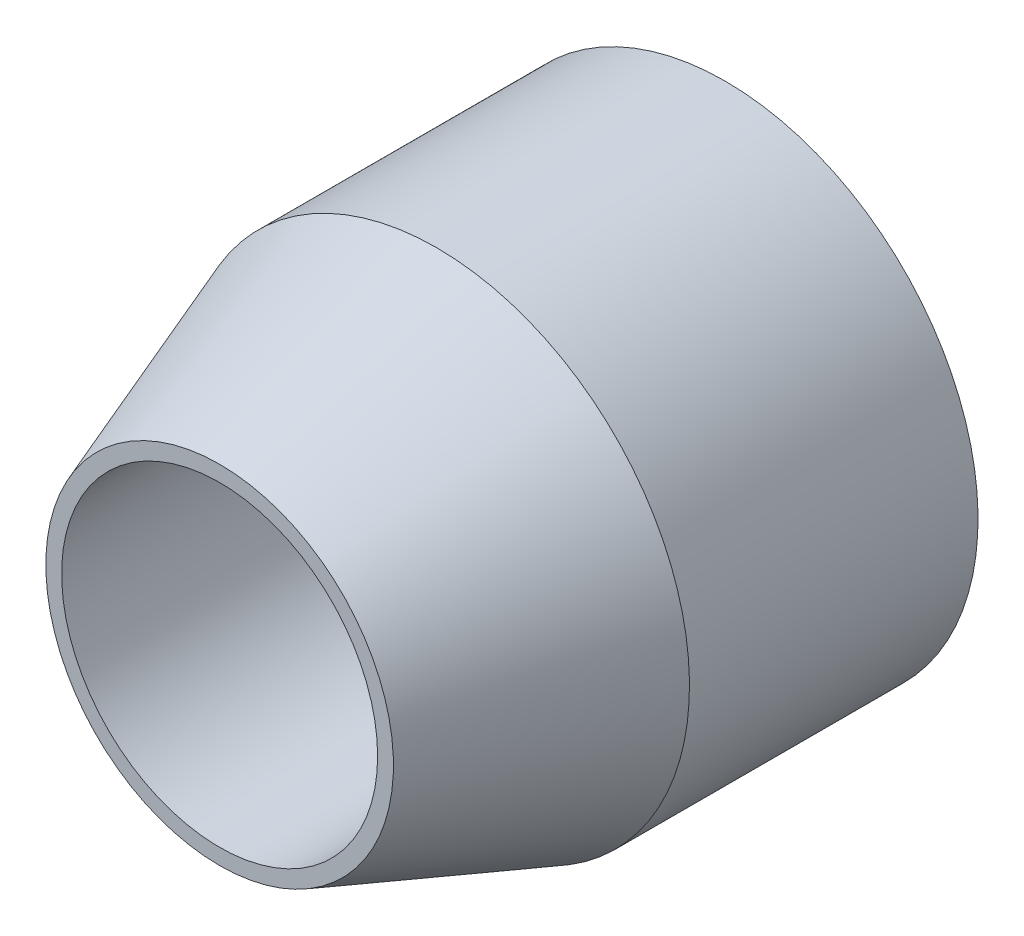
ISO-10303-21;
HEADER;
FILE_DESCRIPTION(('STEP AP214'),'2;1');
FILE_NAME('part.step','',(''),(''),'','','');
FILE_SCHEMA(('AUTOMOTIVE_DESIGN { 1 0 10303 214 1 1 1 1 }'));
ENDSEC;
DATA;
#1=APPLICATION_CONTEXT('core data for automotive mechanical design processes');
#2=APPLICATION_PROTOCOL_DEFINITION('international standard','automotive_design',2000,#1);
#3=PRODUCT_CONTEXT('',#1,'mechanical');
#4=PRODUCT('Part','Part','',(#3));
#5=PRODUCT_RELATED_PRODUCT_CATEGORY('part','',(#4));
#6=PRODUCT_DEFINITION_FORMATION('','',#4);
#7=PRODUCT_DEFINITION_CONTEXT('part definition',#1,'design');
#8=PRODUCT_DEFINITION('design','',#6,#7);
#9=PRODUCT_DEFINITION_SHAPE('','',#8);
#10=(LENGTH_UNIT() NAMED_UNIT(*) SI_UNIT(.MILLI.,.METRE.));
#11=(NAMED_UNIT(*) PLANE_ANGLE_UNIT() SI_UNIT($,.RADIAN.));
#12=(NAMED_UNIT(*) SI_UNIT($,.STERADIAN.) SOLID_ANGLE_UNIT());
#13=UNCERTAINTY_MEASURE_WITH_UNIT(LENGTH_MEASURE(1.E-05),#10,'distance_accuracy_value','');
#14=(GEOMETRIC_REPRESENTATION_CONTEXT(3) GLOBAL_UNCERTAINTY_ASSIGNED_CONTEXT((#13)) GLOBAL_UNIT_ASSIGNED_CONTEXT((#10,
#11,#12)) REPRESENTATION_CONTEXT('',''));
#15=CARTESIAN_POINT('',(0.,0.,0.));
#16=DIRECTION('',(0.,0.,1.));
#17=DIRECTION('',(1.,0.,0.));
#18=AXIS2_PLACEMENT_3D('',#15,#16,#17);
#19=CARTESIAN_POINT('',(0.,0.,-6.35));
#20=DIRECTION('',(0.,0.,-1.));
#21=DIRECTION('',(0.,1.,0.));
#22=AXIS2_PLACEMENT_3D('',#19,#20,#21);
#23=PLANE('',#22);
#24=CARTESIAN_POINT('',(0.,0.,-6.35));
#25=DIRECTION('',(0.,0.,-1.));
#26=DIRECTION('',(0.,1.,0.));
#27=AXIS2_PLACEMENT_3D('',#24,#25,#26);
#28=CIRCLE('',#27,6.35);
#29=CARTESIAN_POINT('',(0.,6.35,-6.35));
#30=VERTEX_POINT('',#29);
#31=EDGE_CURVE('E11',#30,#30,#28,.T.);
#32=ORIENTED_EDGE('',*,*,#31,.T.);
#33=EDGE_LOOP('',(#32));
#34=FACE_BOUND('',#33,.T.);
#35=DIRECTION('',(0.866025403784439,0.5,0.));
#36=VECTOR('',#35,1.);
#37=CARTESIAN_POINT('',(0.,-3.96875,-6.35));
#38=LINE('',#37,#36);
#39=CARTESIAN_POINT('',(0.,-3.96875,-6.35));
#40=VERTEX_POINT('',#39);
#41=CARTESIAN_POINT('',(3.43703832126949,-1.984375,-6.35));
#42=VERTEX_POINT('',#41);
#43=EDGE_CURVE('E193',#40,#42,#38,.T.);
#44=ORIENTED_EDGE('',*,*,#43,.T.);
#45=DIRECTION('',(0.,1.,0.));
#46=VECTOR('',#45,1.);
#47=CARTESIAN_POINT('',(3.43703832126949,-1.984375,-6.35));
#48=LINE('',#47,#46);
#49=CARTESIAN_POINT('',(3.43703832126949,1.984375,-6.35));
#50=VERTEX_POINT('',#49);
#51=EDGE_CURVE('E196',#42,#50,#48,.T.);
#52=ORIENTED_EDGE('',*,*,#51,.T.);
#53=DIRECTION('',(-0.866025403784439,0.5,0.));
#54=VECTOR('',#53,1.);
#55=CARTESIAN_POINT('',(3.43703832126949,1.984375,-6.35));
#56=LINE('',#55,#54);
#57=CARTESIAN_POINT('',(0.,3.96875,-6.35));
#58=VERTEX_POINT('',#57);
#59=EDGE_CURVE('E89',#50,#58,#56,.T.);
#60=ORIENTED_EDGE('',*,*,#59,.T.);
#61=DIRECTION('',(-0.866025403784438,-0.5,0.));
#62=VECTOR('',#61,1.);
#63=CARTESIAN_POINT('',(0.,3.96875,-6.35));
#64=LINE('',#63,#62);
#65=CARTESIAN_POINT('',(-3.43703832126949,1.984375,-6.35));
#66=VERTEX_POINT('',#65);
#67=EDGE_CURVE('E45',#58,#66,#64,.T.);
#68=ORIENTED_EDGE('',*,*,#67,.T.);
#69=DIRECTION('',(0.,-1.,0.));
#70=VECTOR('',#69,1.);
#71=CARTESIAN_POINT('',(-3.43703832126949,1.984375,-6.35));
#72=LINE('',#71,#70);
#73=CARTESIAN_POINT('',(-3.43703832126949,-1.984375,-6.35));
#74=VERTEX_POINT('',#73);
#75=EDGE_CURVE('E187',#66,#74,#72,.T.);
#76=ORIENTED_EDGE('',*,*,#75,.T.);
#77=DIRECTION('',(0.866025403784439,-0.5,0.));
#78=VECTOR('',#77,1.);
#79=CARTESIAN_POINT('',(-3.43703832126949,-1.984375,-6.35));
#80=LINE('',#79,#78);
#81=EDGE_CURVE('E190',#74,#40,#80,.T.);
#82=ORIENTED_EDGE('',*,*,#81,.T.);
#83=EDGE_LOOP('',(#44,#52,#60,#68,#76,#82));
#84=FACE_BOUND('',#83,.T.);
#85=ADVANCED_FACE('F31',(#34,#84),#23,.T.);
#86=CARTESIAN_POINT('',(0.,0.,0.));
#87=DIRECTION('',(0.,0.,1.));
#88=DIRECTION('',(1.,0.,0.));
#89=AXIS2_PLACEMENT_3D('',#86,#87,#88);
#90=CONICAL_SURFACE('',#89,3.96875,1.02974425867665);
#91=CARTESIAN_POINT('',(3.43703832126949,-5.00010604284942,1.26104318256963));
#92=CARTESIAN_POINT('',(3.43703832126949,-4.85722093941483,1.19031289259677));
#93=CARTESIAN_POINT('',(3.43703832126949,-4.71395906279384,1.12032961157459));
#94=CARTESIAN_POINT('',(3.43703832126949,-4.42648772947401,0.982269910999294));
#95=CARTESIAN_POINT('',(3.43703832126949,-4.28227810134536,0.914193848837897));
#96=CARTESIAN_POINT('',(3.43703832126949,-3.99188496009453,0.779978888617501));
#97=CARTESIAN_POINT('',(3.43703832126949,-3.84569476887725,0.713854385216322));
#98=CARTESIAN_POINT('',(3.43703832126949,-3.55200830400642,0.584582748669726));
#99=CARTESIAN_POINT('',(3.43703832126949,-3.40451209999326,0.521435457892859));
#100=CARTESIAN_POINT('',(3.43703832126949,-3.10400936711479,0.397253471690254));
#101=CARTESIAN_POINT('',(3.43703832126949,-2.9509607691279,0.336319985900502));
#102=CARTESIAN_POINT('',(3.43703832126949,-2.64291751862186,0.219492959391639));
#103=CARTESIAN_POINT('',(3.43703832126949,-2.48792264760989,0.163599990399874));
#104=CARTESIAN_POINT('',(3.43703832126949,-2.17608605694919,0.0584056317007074));
#105=CARTESIAN_POINT('',(3.43703832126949,-2.01924940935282,0.00908936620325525));
#106=CARTESIAN_POINT('',(3.43703832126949,-1.70324804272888,-0.0813228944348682));
#107=CARTESIAN_POINT('',(3.43703832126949,-1.54408410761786,-0.122421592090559));
#108=CARTESIAN_POINT('',(3.43703832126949,-1.21766592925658,-0.195665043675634));
#109=CARTESIAN_POINT('',(3.43703832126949,-1.0503261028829,-0.227436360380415));
#110=CARTESIAN_POINT('',(3.43703832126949,-0.713631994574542,-0.277711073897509));
#111=CARTESIAN_POINT('',(3.43703832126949,-0.544277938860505,-0.296215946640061));
#112=CARTESIAN_POINT('',(3.43703832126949,-0.206709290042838,-0.318177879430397));
#113=CARTESIAN_POINT('',(3.43703832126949,-0.0385071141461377,-0.321821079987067));
#114=CARTESIAN_POINT('',(3.43703832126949,0.297575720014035,-0.314215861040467));
#115=CARTESIAN_POINT('',(3.43703832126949,0.465456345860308,-0.302966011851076));
#116=CARTESIAN_POINT('',(3.43703832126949,0.750251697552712,-0.272006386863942));
#117=CARTESIAN_POINT('',(3.43703832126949,0.867564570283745,-0.255779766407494));
#118=CARTESIAN_POINT('',(3.43703832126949,1.10117192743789,-0.217131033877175));
#119=CARTESIAN_POINT('',(3.43703832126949,1.21746626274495,-0.194708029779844));
#120=CARTESIAN_POINT('',(3.43703832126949,1.56471784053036,-0.119260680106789));
#121=CARTESIAN_POINT('',(3.43703832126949,1.79391569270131,-0.0580734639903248));
#122=CARTESIAN_POINT('',(3.43703832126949,2.13655651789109,0.0462687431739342));
#123=CARTESIAN_POINT('',(3.43703832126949,2.25186065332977,0.0836346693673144));
#124=CARTESIAN_POINT('',(3.43703832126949,2.48130331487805,0.161818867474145));
#125=CARTESIAN_POINT('',(3.43703832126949,2.59544183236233,0.202637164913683));
#126=CARTESIAN_POINT('',(3.43703832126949,2.82260033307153,0.287127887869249));
#127=CARTESIAN_POINT('',(3.43703832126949,2.93562071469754,0.330799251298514));
#128=CARTESIAN_POINT('',(3.43703832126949,3.16070198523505,0.42053562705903));
#129=CARTESIAN_POINT('',(3.43703832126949,3.27276289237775,0.466600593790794));
#130=CARTESIAN_POINT('',(3.43703832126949,3.56812951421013,0.591117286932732));
#131=CARTESIAN_POINT('',(3.43703832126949,3.75071539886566,0.6712748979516));
#132=CARTESIAN_POINT('',(3.43703832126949,4.11405354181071,0.835656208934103));
#133=CARTESIAN_POINT('',(3.43703832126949,4.29480563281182,0.919880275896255));
#134=CARTESIAN_POINT('',(3.43703832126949,4.65487623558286,1.09146098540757));
#135=CARTESIAN_POINT('',(3.43703832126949,4.83419432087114,1.17881852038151));
#136=CARTESIAN_POINT('',(3.43703832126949,5.19163194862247,1.35595614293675));
#137=CARTESIAN_POINT('',(3.43703832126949,5.36975145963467,1.4457362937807));
#138=CARTESIAN_POINT('',(3.43703832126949,5.90314806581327,1.71816204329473));
#139=CARTESIAN_POINT('',(3.43703832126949,6.25696985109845,1.90365406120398));
#140=CARTESIAN_POINT('',(3.43703832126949,6.9619346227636,2.2794824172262));
#141=CARTESIAN_POINT('',(3.43703832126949,7.31307805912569,2.46981791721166));
#142=CARTESIAN_POINT('',(3.43703832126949,7.97820710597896,2.8344742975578));
#143=CARTESIAN_POINT('',(3.43703832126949,8.29236882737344,3.00847448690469));
#144=CARTESIAN_POINT('',(3.43703832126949,8.91959665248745,3.35847259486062));
#145=CARTESIAN_POINT('',(3.43703832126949,9.23266269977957,3.53447061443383));
#146=CARTESIAN_POINT('',(3.43703832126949,9.85702823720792,3.88744000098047));
#147=CARTESIAN_POINT('',(3.43703832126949,10.1683302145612,4.06440697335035));
#148=CARTESIAN_POINT('',(3.43703832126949,10.7902479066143,4.41949462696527));
#149=CARTESIAN_POINT('',(3.43703832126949,11.1008636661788,4.5976152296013));
#150=CARTESIAN_POINT('',(3.43703832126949,11.4112344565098,4.77615885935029));
#151=B_SPLINE_CURVE_WITH_KNOTS('',3,(#91,#92,#93,#94,#95,#96,#97,#98,#99,#100,#101,#102,#103,
#104,#105,#106,#107,#108,#109,#110,#111,#112,#113,#114,#115,#116,#117,#118,#119,#120,#121,#122,
#123,#124,#125,#126,#127,#128,#129,#130,#131,#132,#133,#134,#135,#136,#137,#138,#139,#140,#141,
#142,#143,#144,#145,#146,#147,#148,#149,#150),.UNSPECIFIED.,.F.,.F.,(4,2,2,2,2,2,2,2,2,2,2,2,2,
2,2,2,2,2,2,2,2,2,2,2,2,2,2,2,2,4),(0.,0.478306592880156,0.95670222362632,1.43802381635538,
1.9193198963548,2.41344781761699,2.9076317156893,3.40067814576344,3.8935621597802,
4.40410021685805,4.9145814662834,5.41864899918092,5.92276492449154,6.27788431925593,
6.63305486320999,7.34378093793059,7.7073758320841,8.07097341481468,8.43443640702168,
8.79789247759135,9.39603815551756,9.99423791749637,10.5926094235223,11.1909965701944,
12.3894149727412,13.5876273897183,14.6650045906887,15.7424364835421,16.8166944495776,
17.890879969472),.UNSPECIFIED.);
#152=CARTESIAN_POINT('',(3.43703832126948,1.984375,0.));
#153=VERTEX_POINT('',#152);
#154=CARTESIAN_POINT('',(3.43703832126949,-1.984375,0.));
#155=VERTEX_POINT('',#154);
#156=EDGE_CURVE('E95',#153,#155,#151,.F.);
#157=ORIENTED_EDGE('',*,*,#156,.T.);
#158=CARTESIAN_POINT('',(0.,0.,0.));
#159=DIRECTION('',(0.,0.,1.));
#160=DIRECTION('',(1.,0.,0.));
#161=AXIS2_PLACEMENT_3D('',#158,#159,#160);
#162=CIRCLE('',#161,3.96875);
#163=EDGE_CURVE('E118',#155,#153,#162,.T.);
#164=ORIENTED_EDGE('',*,*,#163,.T.);
#165=EDGE_LOOP('',(#157,#164));
#166=FACE_BOUND('',#165,.T.);
#167=ADVANCED_FACE('F179',(#166),#90,.F.);
#168=CARTESIAN_POINT('',(3.43723832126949,-1.98425952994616,6.93844359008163E-05));
#169=CARTESIAN_POINT('',(3.28565097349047,-2.07177852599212,-0.052535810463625));
#170=CARTESIAN_POINT('',(3.13264633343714,-2.16011579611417,-0.100400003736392));
#171=CARTESIAN_POINT('',(2.82375775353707,-2.33845270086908,-0.183923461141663));
#172=CARTESIAN_POINT('',(2.6678672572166,-2.42845612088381,-0.219550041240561));
#173=CARTESIAN_POINT('',(2.35818041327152,-2.60725390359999,-0.274814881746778));
#174=CARTESIAN_POINT('',(2.20444009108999,-2.69601591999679,-0.294856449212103));
#175=CARTESIAN_POINT('',(1.89619313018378,-2.87398238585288,-0.318530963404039));
#176=CARTESIAN_POINT('',(1.7416878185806,-2.9631860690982,-0.322186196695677));
#177=CARTESIAN_POINT('',(1.45436820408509,-3.12907012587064,-0.313425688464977));
#178=CARTESIAN_POINT('',(1.32150030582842,-3.20578144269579,-0.303156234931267));
#179=CARTESIAN_POINT('',(1.05670596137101,-3.35866052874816,-0.270990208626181));
#180=CARTESIAN_POINT('',(0.92478060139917,-3.43482767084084,-0.249081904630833));
#181=CARTESIAN_POINT('',(0.659411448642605,-3.58803862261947,-0.194457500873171));
#182=CARTESIAN_POINT('',(0.526006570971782,-3.66505996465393,-0.161495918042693));
#183=CARTESIAN_POINT('',(0.261335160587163,-3.81786807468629,-0.0868184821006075));
#184=CARTESIAN_POINT('',(0.130064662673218,-3.89365713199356,-0.0451215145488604));
#185=CARTESIAN_POINT('',(-0.000199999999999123,-3.96886547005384,6.9384435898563E-05));
#186=B_SPLINE_CURVE_WITH_KNOTS('',3,(#168,#169,#170,#171,#172,#173,#174,#175,#176,#177,#178,
#179,#180,#181,#182,#183,#184,#185),.UNSPECIFIED.,.F.,.F.,(4,2,2,2,2,2,2,2,4),(0.,
0.54855831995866,1.09857053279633,1.63382645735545,2.16835417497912,2.629184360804,
3.09047991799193,3.56278583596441,4.03408099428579),.UNSPECIFIED.);
#187=CARTESIAN_POINT('',(0.,-3.96875,0.));
#188=VERTEX_POINT('',#187);
#189=EDGE_CURVE('E149',#155,#188,#186,.T.);
#190=ORIENTED_EDGE('',*,*,#189,.T.);
#191=EDGE_CURVE('E123',#188,#155,#162,.T.);
#192=ORIENTED_EDGE('',*,*,#191,.T.);
#193=EDGE_LOOP('',(#190,#192));
#194=FACE_BOUND('',#193,.T.);
#195=ADVANCED_FACE('F215',(#194),#90,.F.);
#196=CARTESIAN_POINT('',(0.000200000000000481,-3.96886547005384,6.93844358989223E-05));
#197=CARTESIAN_POINT('',(-0.151387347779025,-3.88134647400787,-0.0525358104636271));
#198=CARTESIAN_POINT('',(-0.30439198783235,-3.79300920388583,-0.100400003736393));
#199=CARTESIAN_POINT('',(-0.613280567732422,-3.61467229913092,-0.183923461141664));
#200=CARTESIAN_POINT('',(-0.769171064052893,-3.52466887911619,-0.219550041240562));
#201=CARTESIAN_POINT('',(-1.07885790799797,-3.34587109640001,-0.274814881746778));
#202=CARTESIAN_POINT('',(-1.2325982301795,-3.25710908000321,-0.294856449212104));
#203=CARTESIAN_POINT('',(-1.54084519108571,-3.07914261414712,-0.318530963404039));
#204=CARTESIAN_POINT('',(-1.69535050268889,-2.9899389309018,-0.322186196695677));
#205=CARTESIAN_POINT('',(-1.9826701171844,-2.82405487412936,-0.313425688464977));
#206=CARTESIAN_POINT('',(-2.11553801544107,-2.74734355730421,-0.303156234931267));
#207=CARTESIAN_POINT('',(-2.38033235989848,-2.59446447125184,-0.270990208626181));
#208=CARTESIAN_POINT('',(-2.51225771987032,-2.51829732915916,-0.249081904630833));
#209=CARTESIAN_POINT('',(-2.77762687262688,-2.36508637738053,-0.19445750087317));
#210=CARTESIAN_POINT('',(-2.91103175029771,-2.28806503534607,-0.161495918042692));
#211=CARTESIAN_POINT('',(-3.17570316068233,-2.13525692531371,-0.0868184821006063));
#212=CARTESIAN_POINT('',(-3.30697365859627,-2.05946786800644,-0.0451215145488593));
#213=CARTESIAN_POINT('',(-3.43723832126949,-1.98425952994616,6.93844358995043E-05));
#214=B_SPLINE_CURVE_WITH_KNOTS('',3,(#196,#197,#198,#199,#200,#201,#202,#203,#204,#205,#206,
#207,#208,#209,#210,#211,#212,#213),.UNSPECIFIED.,.F.,.F.,(4,2,2,2,2,2,2,2,4),(0.,
0.54855831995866,1.09857053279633,1.63382645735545,2.16835417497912,2.629184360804,
3.09047991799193,3.56278583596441,4.03408099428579),.UNSPECIFIED.);
#215=CARTESIAN_POINT('',(-3.43703832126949,-1.984375,0.));
#216=VERTEX_POINT('',#215);
#217=EDGE_CURVE('E155',#188,#216,#214,.T.);
#218=ORIENTED_EDGE('',*,*,#217,.T.);
#219=EDGE_CURVE('E127',#216,#188,#162,.T.);
#220=ORIENTED_EDGE('',*,*,#219,.T.);
#221=EDGE_LOOP('',(#218,#220));
#222=FACE_BOUND('',#221,.T.);
#223=ADVANCED_FACE('F218',(#222),#90,.F.);
#224=CARTESIAN_POINT('',(-3.43703832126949,-5.00010604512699,1.26104318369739));
#225=CARTESIAN_POINT('',(-3.43703832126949,-4.85722094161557,1.19031289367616));
#226=CARTESIAN_POINT('',(-3.43703832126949,-4.71395906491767,1.12032961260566));
#227=CARTESIAN_POINT('',(-3.43703832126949,-4.4264877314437,0.982269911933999));
#228=CARTESIAN_POINT('',(-3.43703832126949,-4.28227810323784,0.914193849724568));
#229=CARTESIAN_POINT('',(-3.43703832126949,-3.99188496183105,0.77997888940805));
#230=CARTESIAN_POINT('',(-3.43703832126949,-3.84569477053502,0.713854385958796));
#231=CARTESIAN_POINT('',(-3.43703832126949,-3.55200830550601,0.584582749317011));
#232=CARTESIAN_POINT('',(-3.43703832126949,-3.40451210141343,0.521435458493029));
#233=CARTESIAN_POINT('',(-3.43703832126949,-3.10400936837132,0.397253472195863));
#234=CARTESIAN_POINT('',(-3.43703832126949,-2.95096077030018,0.336319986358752));
#235=CARTESIAN_POINT('',(-3.43703832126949,-2.64291751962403,0.219492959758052));
#236=CARTESIAN_POINT('',(-3.43703832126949,-2.48792264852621,0.163599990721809));
#237=CARTESIAN_POINT('',(-3.43703832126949,-2.17608605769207,0.0584056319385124));
#238=CARTESIAN_POINT('',(-3.43703832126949,-2.01924941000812,0.00908936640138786));
#239=CARTESIAN_POINT('',(-3.43703832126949,-1.70324804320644,-0.0813228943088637));
#240=CARTESIAN_POINT('',(-3.43703832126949,-1.54408410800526,-0.122421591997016));
#241=CARTESIAN_POINT('',(-3.43703832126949,-1.21766592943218,-0.195665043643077));
#242=CARTESIAN_POINT('',(-3.43703832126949,-1.05032610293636,-0.227436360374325));
#243=CARTESIAN_POINT('',(-3.43703832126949,-0.713631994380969,-0.277711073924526));
#244=CARTESIAN_POINT('',(-3.43703832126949,-0.544277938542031,-0.296215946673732));
#245=CARTESIAN_POINT('',(-3.43703832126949,-0.206709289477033,-0.318177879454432));
#246=CARTESIAN_POINT('',(-3.43703832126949,-0.0385071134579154,-0.32182107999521));
#247=CARTESIAN_POINT('',(-3.43703832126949,0.297575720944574,-0.314215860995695));
#248=CARTESIAN_POINT('',(-3.43703832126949,0.465456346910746,-0.302966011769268));
#249=CARTESIAN_POINT('',(-3.43703832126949,0.750251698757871,-0.272006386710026));
#250=CARTESIAN_POINT('',(-3.43703832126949,0.867564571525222,-0.255779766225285));
#251=CARTESIAN_POINT('',(-3.43703832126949,1.10117192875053,-0.217131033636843));
#252=CARTESIAN_POINT('',(-3.43703832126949,1.21746626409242,-0.194708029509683));
#253=CARTESIAN_POINT('',(-3.43703832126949,1.56471784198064,-0.119260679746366));
#254=CARTESIAN_POINT('',(-3.43703832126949,1.79391569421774,-0.0580734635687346));
#255=CARTESIAN_POINT('',(-3.43703832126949,2.13655651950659,0.0462687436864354));
#256=CARTESIAN_POINT('',(-3.43703832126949,2.25186065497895,0.0836346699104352));
#257=CARTESIAN_POINT('',(-3.43703832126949,2.48130331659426,0.161818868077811));
#258=CARTESIAN_POINT('',(-3.43703832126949,2.59544183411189,0.202637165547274));
#259=CARTESIAN_POINT('',(-3.43703832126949,2.82260033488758,0.28712788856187));
#260=CARTESIAN_POINT('',(-3.43703832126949,2.93562071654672,0.33079925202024));
#261=CARTESIAN_POINT('',(-3.43703832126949,3.16070198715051,0.420535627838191));
#262=CARTESIAN_POINT('',(-3.43703832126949,3.27276289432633,0.466600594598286));
#263=CARTESIAN_POINT('',(-3.43703832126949,3.56812951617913,0.591117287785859));
#264=CARTESIAN_POINT('',(-3.43703832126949,3.75071540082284,0.671274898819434));
#265=CARTESIAN_POINT('',(-3.43703832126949,4.11405354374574,0.835656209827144));
#266=CARTESIAN_POINT('',(-3.43703832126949,4.29480563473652,0.919880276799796));
#267=CARTESIAN_POINT('',(-3.43703832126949,4.65487623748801,1.09146098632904));
#268=CARTESIAN_POINT('',(-3.43703832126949,4.83419432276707,1.17881852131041));
#269=CARTESIAN_POINT('',(-3.43703832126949,5.1916319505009,1.35595614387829));
#270=CARTESIAN_POINT('',(-3.43703832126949,5.36975146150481,1.44573629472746));
#271=CARTESIAN_POINT('',(-3.43703832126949,5.90314806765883,1.71816204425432));
#272=CARTESIAN_POINT('',(-3.43703832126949,6.2569698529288,1.90365406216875));
#273=CARTESIAN_POINT('',(-3.43703832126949,6.9619346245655,2.27948241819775));
#274=CARTESIAN_POINT('',(-3.43703832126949,7.31307806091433,2.46981791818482));
#275=CARTESIAN_POINT('',(-3.43703832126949,7.97820710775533,2.83447429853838));
#276=CARTESIAN_POINT('',(-3.43703832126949,8.29236882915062,3.00847448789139));
#277=CARTESIAN_POINT('',(-3.43703832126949,8.91959665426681,3.35847259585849));
#278=CARTESIAN_POINT('',(-3.43703832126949,9.23266270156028,3.53447061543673));
#279=CARTESIAN_POINT('',(-3.43703832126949,9.85702823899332,3.88744000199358));
#280=CARTESIAN_POINT('',(-3.43703832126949,10.1683302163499,4.06440697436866));
#281=CARTESIAN_POINT('',(-3.43703832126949,10.79024790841,4.41949462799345));
#282=CARTESIAN_POINT('',(-3.43703832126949,11.1008636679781,4.59761523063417));
#283=CARTESIAN_POINT('',(-3.43703832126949,11.4112344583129,4.77615886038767));
#284=B_SPLINE_CURVE_WITH_KNOTS('',3,(#224,#225,#226,#227,#228,#229,#230,#231,#232,#233,#234,
#235,#236,#237,#238,#239,#240,#241,#242,#243,#244,#245,#246,#247,#248,#249,#250,#251,#252,#253,
#254,#255,#256,#257,#258,#259,#260,#261,#262,#263,#264,#265,#266,#267,#268,#269,#270,#271,#272,
#273,#274,#275,#276,#277,#278,#279,#280,#281,#282,#283),.UNSPECIFIED.,.F.,.F.,(4,2,2,2,2,2,2,2,
2,2,2,2,2,2,2,2,2,2,2,2,2,2,2,2,2,2,2,2,2,4),(0.,0.478306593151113,0.956702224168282,
1.43802381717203,1.91931989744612,2.41344781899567,2.90763171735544,3.40067814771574,
3.89356216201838,4.40410021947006,4.91458146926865,5.41864900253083,5.92276492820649,
6.27788432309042,6.63305486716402,7.34378094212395,7.70737583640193,8.07097341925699,
8.43443641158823,8.79789248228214,9.39603816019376,9.99423792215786,10.5926094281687,
11.1909965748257,12.3894149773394,13.5876273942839,14.6650045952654,15.7424364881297,
16.8166944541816,17.8908799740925),.UNSPECIFIED.);
#285=CARTESIAN_POINT('',(-3.43703832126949,1.98437499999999,0.));
#286=VERTEX_POINT('',#285);
#287=EDGE_CURVE('E103',#216,#286,#284,.T.);
#288=ORIENTED_EDGE('',*,*,#287,.T.);
#289=EDGE_CURVE('E114',#286,#216,#162,.T.);
#290=ORIENTED_EDGE('',*,*,#289,.T.);
#291=EDGE_LOOP('',(#288,#290));
#292=FACE_BOUND('',#291,.T.);
#293=ADVANCED_FACE('F220',(#292),#90,.F.);
#294=CARTESIAN_POINT('',(-3.43723832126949,1.98425952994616,6.93844359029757E-05));
#295=CARTESIAN_POINT('',(-3.28565097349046,2.07177852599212,-0.0525358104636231));
#296=CARTESIAN_POINT('',(-3.13264633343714,2.16011579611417,-0.10040000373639));
#297=CARTESIAN_POINT('',(-2.82375775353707,2.33845270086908,-0.18392346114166));
#298=CARTESIAN_POINT('',(-2.6678672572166,2.42845612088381,-0.219550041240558));
#299=CARTESIAN_POINT('',(-2.35818041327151,2.60725390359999,-0.274814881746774));
#300=CARTESIAN_POINT('',(-2.20444009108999,2.69601591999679,-0.2948564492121));
#301=CARTESIAN_POINT('',(-1.89619313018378,2.87398238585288,-0.318530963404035));
#302=CARTESIAN_POINT('',(-1.7416878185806,2.9631860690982,-0.322186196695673));
#303=CARTESIAN_POINT('',(-1.45436820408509,3.12907012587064,-0.313425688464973));
#304=CARTESIAN_POINT('',(-1.32150030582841,3.20578144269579,-0.303156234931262));
#305=CARTESIAN_POINT('',(-1.05670596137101,3.35866052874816,-0.270990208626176));
#306=CARTESIAN_POINT('',(-0.924780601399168,3.43482767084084,-0.249081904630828));
#307=CARTESIAN_POINT('',(-0.659411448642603,3.58803862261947,-0.194457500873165));
#308=CARTESIAN_POINT('',(-0.52600657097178,3.66505996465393,-0.161495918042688));
#309=CARTESIAN_POINT('',(-0.261335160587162,3.81786807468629,-0.0868184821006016));
#310=CARTESIAN_POINT('',(-0.130064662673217,3.89365713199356,-0.0451215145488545));
#311=CARTESIAN_POINT('',(0.00020000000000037,3.96886547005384,6.93844359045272E-05));
#312=B_SPLINE_CURVE_WITH_KNOTS('',3,(#294,#295,#296,#297,#298,#299,#300,#301,#302,#303,#304,
#305,#306,#307,#308,#309,#310,#311),.UNSPECIFIED.,.F.,.F.,(4,2,2,2,2,2,2,2,4),(0.,
0.548558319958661,1.09857053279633,1.63382645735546,2.16835417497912,2.629184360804,
3.09047991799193,3.56278583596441,4.03408099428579),.UNSPECIFIED.);
#313=CARTESIAN_POINT('',(0.,3.96874999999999,0.));
#314=VERTEX_POINT('',#313);
#315=EDGE_CURVE('E90',#286,#314,#312,.T.);
#316=ORIENTED_EDGE('',*,*,#315,.T.);
#317=EDGE_CURVE('E102',#314,#286,#162,.T.);
#318=ORIENTED_EDGE('',*,*,#317,.T.);
#319=EDGE_LOOP('',(#316,#318));
#320=FACE_BOUND('',#319,.T.);
#321=ADVANCED_FACE('F101',(#320),#90,.F.);
#322=CARTESIAN_POINT('',(-0.000200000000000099,3.96886547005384,6.93844359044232E-05));
#323=CARTESIAN_POINT('',(0.151387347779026,3.88134647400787,-0.0525358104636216));
#324=CARTESIAN_POINT('',(0.304391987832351,3.79300920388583,-0.100400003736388));
#325=CARTESIAN_POINT('',(0.613280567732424,3.61467229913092,-0.183923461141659));
#326=CARTESIAN_POINT('',(0.769171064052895,3.52466887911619,-0.219550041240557));
#327=CARTESIAN_POINT('',(1.07885790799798,3.34587109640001,-0.274814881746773));
#328=CARTESIAN_POINT('',(1.2325982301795,3.25710908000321,-0.294856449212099));
#329=CARTESIAN_POINT('',(1.54084519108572,3.07914261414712,-0.318530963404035));
#330=CARTESIAN_POINT('',(1.6953505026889,2.9899389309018,-0.322186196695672));
#331=CARTESIAN_POINT('',(1.98267011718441,2.82405487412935,-0.313425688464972));
#332=CARTESIAN_POINT('',(2.11553801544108,2.74734355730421,-0.303156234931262));
#333=CARTESIAN_POINT('',(2.38033235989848,2.59446447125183,-0.270990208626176));
#334=CARTESIAN_POINT('',(2.51225771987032,2.51829732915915,-0.249081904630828));
#335=CARTESIAN_POINT('',(2.77762687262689,2.36508637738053,-0.194457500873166));
#336=CARTESIAN_POINT('',(2.91103175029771,2.28806503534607,-0.161495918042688));
#337=CARTESIAN_POINT('',(3.17570316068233,2.13525692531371,-0.0868184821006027));
#338=CARTESIAN_POINT('',(3.30697365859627,2.05946786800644,-0.0451215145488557));
#339=CARTESIAN_POINT('',(3.43723832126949,1.98425952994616,6.93844359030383E-05));
#340=B_SPLINE_CURVE_WITH_KNOTS('',3,(#322,#323,#324,#325,#326,#327,#328,#329,#330,#331,#332,
#333,#334,#335,#336,#337,#338,#339),.UNSPECIFIED.,.F.,.F.,(4,2,2,2,2,2,2,2,4),(0.,
0.548558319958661,1.09857053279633,1.63382645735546,2.16835417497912,2.62918436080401,
3.09047991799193,3.56278583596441,4.03408099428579),.UNSPECIFIED.);
#341=EDGE_CURVE('E82',#314,#153,#340,.T.);
#342=ORIENTED_EDGE('',*,*,#341,.T.);
#343=EDGE_CURVE('E111',#153,#314,#162,.T.);
#344=ORIENTED_EDGE('',*,*,#343,.T.);
#345=EDGE_LOOP('',(#342,#344));
#346=FACE_BOUND('',#345,.T.);
#347=ADVANCED_FACE('F116',(#346),#90,.F.);
#348=CARTESIAN_POINT('',(0.,0.,-31.1289207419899));
#349=DIRECTION('',(0.,0.,-1.));
#350=DIRECTION('',(0.,1.,0.));
#351=AXIS2_PLACEMENT_3D('',#348,#349,#350);
#352=CYLINDRICAL_SURFACE('',#351,6.35);
#353=CARTESIAN_POINT('',(0.,0.,0.897974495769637));
#354=DIRECTION('',(0.,0.,-1.));
#355=DIRECTION('',(0.,1.,0.));
#356=AXIS2_PLACEMENT_3D('',#353,#354,#355);
#357=CIRCLE('',#356,6.35);
#358=CARTESIAN_POINT('',(0.,6.35,0.897974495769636));
#359=VERTEX_POINT('',#358);
#360=EDGE_CURVE('E38',#359,#359,#357,.T.);
#361=ORIENTED_EDGE('',*,*,#360,.T.);
#362=EDGE_LOOP('',(#361));
#363=FACE_BOUND('',#362,.T.);
#364=ORIENTED_EDGE('',*,*,#31,.F.);
#365=EDGE_LOOP('',(#364));
#366=FACE_BOUND('',#365,.T.);
#367=ADVANCED_FACE('F232',(#363,#366),#352,.T.);
#368=CARTESIAN_POINT('',(0.,0.,0.897974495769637));
#369=DIRECTION('',(0.,0.,-1.));
#370=DIRECTION('',(0.,1.,0.));
#371=AXIS2_PLACEMENT_3D('',#368,#369,#370);
#372=CONICAL_SURFACE('',#371,6.35,0.34906585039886);
#373=CARTESIAN_POINT('',(0.,0.,6.35));
#374=DIRECTION('',(0.,0.,-1.));
#375=DIRECTION('',(0.,1.,0.));
#376=AXIS2_PLACEMENT_3D('',#373,#374,#375);
#377=CIRCLE('',#376,4.365625);
#378=CARTESIAN_POINT('',(0.,4.365625,6.35));
#379=VERTEX_POINT('',#378);
#380=EDGE_CURVE('E120',#379,#379,#377,.T.);
#381=ORIENTED_EDGE('',*,*,#380,.T.);
#382=EDGE_LOOP('',(#381));
#383=FACE_BOUND('',#382,.T.);
#384=ORIENTED_EDGE('',*,*,#360,.F.);
#385=EDGE_LOOP('',(#384));
#386=FACE_BOUND('',#385,.T.);
#387=ADVANCED_FACE('F234',(#383,#386),#372,.T.);
#388=CARTESIAN_POINT('',(0.,4.365625,6.35));
#389=DIRECTION('',(0.,0.,1.));
#390=DIRECTION('',(0.,-1.,0.));
#391=AXIS2_PLACEMENT_3D('',#388,#389,#390);
#392=PLANE('',#391);
#393=CARTESIAN_POINT('',(0.,0.,6.35));
#394=DIRECTION('',(0.,0.,1.));
#395=DIRECTION('',(1.,0.,0.));
#396=AXIS2_PLACEMENT_3D('',#393,#394,#395);
#397=CIRCLE('',#396,3.96875);
#398=CARTESIAN_POINT('',(3.96875,0.,6.35));
#399=VERTEX_POINT('',#398);
#400=EDGE_CURVE('E117',#399,#399,#397,.T.);
#401=ORIENTED_EDGE('',*,*,#400,.F.);
#402=EDGE_LOOP('',(#401));
#403=FACE_BOUND('',#402,.T.);
#404=ORIENTED_EDGE('',*,*,#380,.F.);
#405=EDGE_LOOP('',(#404));
#406=FACE_BOUND('',#405,.T.);
#407=ADVANCED_FACE('F240',(#403,#406),#392,.T.);
#408=CARTESIAN_POINT('',(0.,0.,6.35));
#409=DIRECTION('',(0.,0.,1.));
#410=DIRECTION('',(1.,0.,0.));
#411=AXIS2_PLACEMENT_3D('',#408,#409,#410);
#412=CYLINDRICAL_SURFACE('',#411,3.96875);
#413=ORIENTED_EDGE('',*,*,#343,.F.);
#414=ORIENTED_EDGE('',*,*,#163,.F.);
#415=ORIENTED_EDGE('',*,*,#191,.F.);
#416=ORIENTED_EDGE('',*,*,#219,.F.);
#417=ORIENTED_EDGE('',*,*,#289,.F.);
#418=ORIENTED_EDGE('',*,*,#317,.F.);
#419=EDGE_LOOP('',(#413,#414,#415,#416,#417,#418));
#420=FACE_BOUND('',#419,.T.);
#421=ORIENTED_EDGE('',*,*,#400,.T.);
#422=EDGE_LOOP('',(#421));
#423=FACE_BOUND('',#422,.T.);
#424=ADVANCED_FACE('F108',(#420,#423),#412,.F.);
#425=CARTESIAN_POINT('',(3.43703832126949,-1.984375,6.351));
#426=DIRECTION('',(-1.,0.,0.));
#427=DIRECTION('',(0.,-1.,0.));
#428=AXIS2_PLACEMENT_3D('',#425,#426,#427);
#429=PLANE('',#428);
#430=DIRECTION('',(0.,0.,-1.));
#431=VECTOR('',#430,1.);
#432=CARTESIAN_POINT('',(3.43703832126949,1.984375,6.351));
#433=LINE('',#432,#431);
#434=EDGE_CURVE('E53',#153,#50,#433,.T.);
#435=ORIENTED_EDGE('',*,*,#434,.T.);
#436=ORIENTED_EDGE('',*,*,#51,.F.);
#437=DIRECTION('',(0.,0.,-1.));
#438=VECTOR('',#437,1.);
#439=CARTESIAN_POINT('',(3.43703832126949,-1.984375,6.351));
#440=LINE('',#439,#438);
#441=EDGE_CURVE('E200',#155,#42,#440,.T.);
#442=ORIENTED_EDGE('',*,*,#441,.F.);
#443=ORIENTED_EDGE('',*,*,#156,.F.);
#444=EDGE_LOOP('',(#435,#436,#442,#443));
#445=FACE_BOUND('',#444,.T.);
#446=ADVANCED_FACE('F135',(#445),#429,.T.);
#447=CARTESIAN_POINT('',(0.,-3.96875,6.351));
#448=DIRECTION('',(-0.5,0.866025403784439,0.));
#449=DIRECTION('',(-0.866025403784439,-0.5,0.));
#450=AXIS2_PLACEMENT_3D('',#447,#448,#449);
#451=PLANE('',#450);
#452=ORIENTED_EDGE('',*,*,#441,.T.);
#453=ORIENTED_EDGE('',*,*,#43,.F.);
#454=DIRECTION('',(0.,0.,-1.));
#455=VECTOR('',#454,1.);
#456=CARTESIAN_POINT('',(0.,-3.96875,6.351));
#457=LINE('',#456,#455);
#458=EDGE_CURVE('E202',#188,#40,#457,.T.);
#459=ORIENTED_EDGE('',*,*,#458,.F.);
#460=ORIENTED_EDGE('',*,*,#189,.F.);
#461=EDGE_LOOP('',(#452,#453,#459,#460));
#462=FACE_BOUND('',#461,.T.);
#463=ADVANCED_FACE('F139',(#462),#451,.T.);
#464=CARTESIAN_POINT('',(-3.43703832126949,-1.984375,6.351));
#465=DIRECTION('',(0.5,0.866025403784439,0.));
#466=DIRECTION('',(-0.866025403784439,0.5,0.));
#467=AXIS2_PLACEMENT_3D('',#464,#465,#466);
#468=PLANE('',#467);
#469=ORIENTED_EDGE('',*,*,#458,.T.);
#470=ORIENTED_EDGE('',*,*,#81,.F.);
#471=DIRECTION('',(0.,0.,-1.));
#472=VECTOR('',#471,1.);
#473=CARTESIAN_POINT('',(-3.43703832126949,-1.984375,6.351));
#474=LINE('',#473,#472);
#475=EDGE_CURVE('E204',#216,#74,#474,.T.);
#476=ORIENTED_EDGE('',*,*,#475,.F.);
#477=ORIENTED_EDGE('',*,*,#217,.F.);
#478=EDGE_LOOP('',(#469,#470,#476,#477));
#479=FACE_BOUND('',#478,.T.);
#480=ADVANCED_FACE('F144',(#479),#468,.T.);
#481=CARTESIAN_POINT('',(-3.43703832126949,1.984375,6.351));
#482=DIRECTION('',(1.,0.,0.));
#483=DIRECTION('',(0.,1.,0.));
#484=AXIS2_PLACEMENT_3D('',#481,#482,#483);
#485=PLANE('',#484);
#486=ORIENTED_EDGE('',*,*,#475,.T.);
#487=ORIENTED_EDGE('',*,*,#75,.F.);
#488=DIRECTION('',(0.,0.,-1.));
#489=VECTOR('',#488,1.);
#490=CARTESIAN_POINT('',(-3.43703832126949,1.984375,6.351));
#491=LINE('',#490,#489);
#492=EDGE_CURVE('E96',#286,#66,#491,.T.);
#493=ORIENTED_EDGE('',*,*,#492,.F.);
#494=ORIENTED_EDGE('',*,*,#287,.F.);
#495=EDGE_LOOP('',(#486,#487,#493,#494));
#496=FACE_BOUND('',#495,.T.);
#497=ADVANCED_FACE('F169',(#496),#485,.T.);
#498=CARTESIAN_POINT('',(0.,3.96875,6.351));
#499=DIRECTION('',(0.5,-0.866025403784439,0.));
#500=DIRECTION('',(0.866025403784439,0.5,0.));
#501=AXIS2_PLACEMENT_3D('',#498,#499,#500);
#502=PLANE('',#501);
#503=ORIENTED_EDGE('',*,*,#492,.T.);
#504=ORIENTED_EDGE('',*,*,#67,.F.);
#505=DIRECTION('',(0.,0.,-1.));
#506=VECTOR('',#505,1.);
#507=CARTESIAN_POINT('',(0.,3.96875,6.351));
#508=LINE('',#507,#506);
#509=EDGE_CURVE('E84',#314,#58,#508,.T.);
#510=ORIENTED_EDGE('',*,*,#509,.F.);
#511=ORIENTED_EDGE('',*,*,#315,.F.);
#512=EDGE_LOOP('',(#503,#504,#510,#511));
#513=FACE_BOUND('',#512,.T.);
#514=ADVANCED_FACE('F93',(#513),#502,.T.);
#515=CARTESIAN_POINT('',(3.43703832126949,1.984375,6.351));
#516=DIRECTION('',(-0.5,-0.866025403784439,0.));
#517=DIRECTION('',(0.866025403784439,-0.5,0.));
#518=AXIS2_PLACEMENT_3D('',#515,#516,#517);
#519=PLANE('',#518);
#520=ORIENTED_EDGE('',*,*,#509,.T.);
#521=ORIENTED_EDGE('',*,*,#59,.F.);
#522=ORIENTED_EDGE('',*,*,#434,.F.);
#523=ORIENTED_EDGE('',*,*,#341,.F.);
#524=EDGE_LOOP('',(#520,#521,#522,#523));
#525=FACE_BOUND('',#524,.T.);
#526=ADVANCED_FACE('F83',(#525),#519,.T.);
#527=CLOSED_SHELL('',(#85,#167,#195,#223,#293,#321,#347,#367,#387,#407,#424,#446,#463,#480,#497,
#514,#526));
#528=MANIFOLD_SOLID_BREP('B2',#527);
#529=ADVANCED_BREP_SHAPE_REPRESENTATION('',(#18,#528),#14);
#530=SHAPE_DEFINITION_REPRESENTATION(#9,#529);
ENDSEC;
END-ISO-10303-21;
